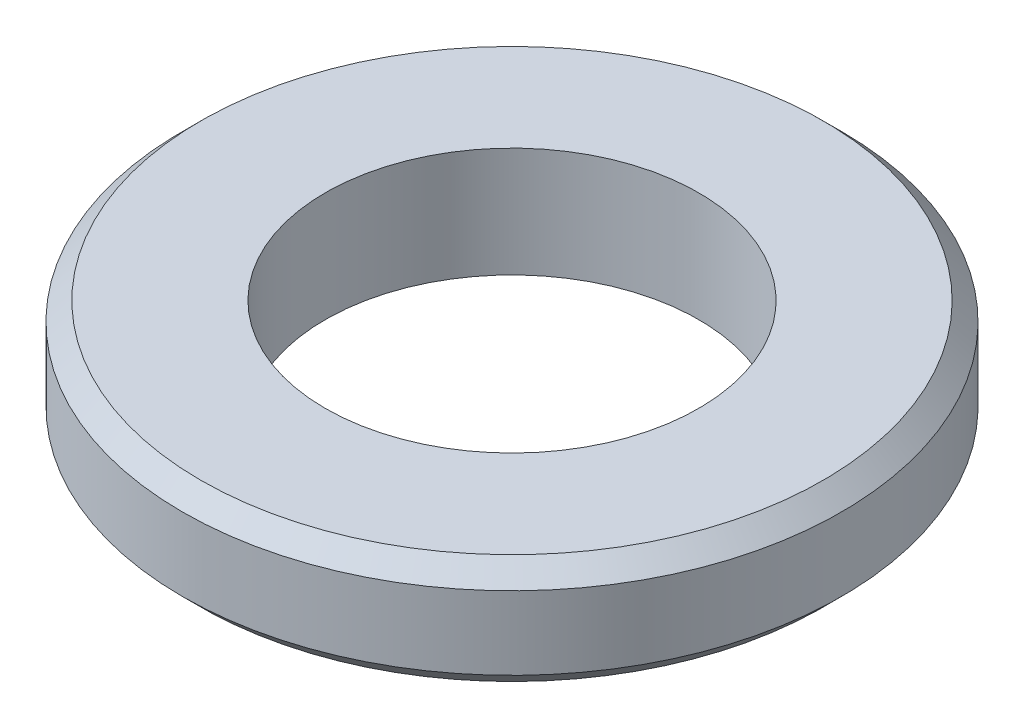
ISO-10303-21;
HEADER;
FILE_DESCRIPTION(('STEP AP214'),'2;1');
FILE_NAME('part.step','',(''),(''),'','','');
FILE_SCHEMA(('AUTOMOTIVE_DESIGN { 1 0 10303 214 1 1 1 1 }'));
ENDSEC;
DATA;
#1=APPLICATION_CONTEXT('core data for automotive mechanical design processes');
#2=APPLICATION_PROTOCOL_DEFINITION('international standard','automotive_design',2000,#1);
#3=PRODUCT_CONTEXT('',#1,'mechanical');
#4=PRODUCT('Part','Part','',(#3));
#5=PRODUCT_RELATED_PRODUCT_CATEGORY('part','',(#4));
#6=PRODUCT_DEFINITION_FORMATION('','',#4);
#7=PRODUCT_DEFINITION_CONTEXT('part definition',#1,'design');
#8=PRODUCT_DEFINITION('design','',#6,#7);
#9=PRODUCT_DEFINITION_SHAPE('','',#8);
#10=(LENGTH_UNIT() NAMED_UNIT(*) SI_UNIT(.MILLI.,.METRE.));
#11=(NAMED_UNIT(*) PLANE_ANGLE_UNIT() SI_UNIT($,.RADIAN.));
#12=(NAMED_UNIT(*) SI_UNIT($,.STERADIAN.) SOLID_ANGLE_UNIT());
#13=UNCERTAINTY_MEASURE_WITH_UNIT(LENGTH_MEASURE(1.E-05),#10,'distance_accuracy_value','');
#14=(GEOMETRIC_REPRESENTATION_CONTEXT(3) GLOBAL_UNCERTAINTY_ASSIGNED_CONTEXT((#13)) GLOBAL_UNIT_ASSIGNED_CONTEXT((#10,
#11,#12)) REPRESENTATION_CONTEXT('',''));
#15=CARTESIAN_POINT('',(0.,0.,0.));
#16=DIRECTION('',(0.,0.,1.));
#17=DIRECTION('',(1.,0.,0.));
#18=AXIS2_PLACEMENT_3D('',#15,#16,#17);
#19=CARTESIAN_POINT('',(0.,6.53689538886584,0.));
#20=DIRECTION('',(0.,1.,0.));
#21=DIRECTION('',(0.,0.,1.));
#22=AXIS2_PLACEMENT_3D('',#19,#20,#21);
#23=CYLINDRICAL_SURFACE('',#22,9.);
#24=CARTESIAN_POINT('',(0.,-2.61128311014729,0.));
#25=DIRECTION('',(0.,-1.,0.));
#26=DIRECTION('',(0.,0.,-1.));
#27=AXIS2_PLACEMENT_3D('',#24,#25,#26);
#28=CIRCLE('',#27,9.);
#29=CARTESIAN_POINT('',(0.,-2.61128311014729,-9.));
#30=VERTEX_POINT('',#29);
#31=EDGE_CURVE('E39',#30,#30,#28,.F.);
#32=ORIENTED_EDGE('',*,*,#31,.T.);
#33=EDGE_LOOP('',(#32));
#34=FACE_BOUND('',#33,.T.);
#35=CARTESIAN_POINT('',(0.,-0.611283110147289,0.));
#36=DIRECTION('',(0.,1.,0.));
#37=DIRECTION('',(0.,0.,1.));
#38=AXIS2_PLACEMENT_3D('',#35,#36,#37);
#39=CIRCLE('',#38,9.);
#40=CARTESIAN_POINT('',(0.,-0.611283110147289,9.));
#41=VERTEX_POINT('',#40);
#42=EDGE_CURVE('E43',#41,#41,#39,.F.);
#43=ORIENTED_EDGE('',*,*,#42,.T.);
#44=EDGE_LOOP('',(#43));
#45=FACE_BOUND('',#44,.T.);
#46=ADVANCED_FACE('F28',(#34,#45),#23,.T.);
#47=CARTESIAN_POINT('',(-9.,-3.11128311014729,0.));
#48=DIRECTION('',(0.,-1.,0.));
#49=DIRECTION('',(0.,0.,-1.));
#50=AXIS2_PLACEMENT_3D('',#47,#48,#49);
#51=PLANE('',#50);
#52=CARTESIAN_POINT('',(0.,-3.11128311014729,0.));
#53=DIRECTION('',(0.,-1.,0.));
#54=DIRECTION('',(0.,0.,-1.));
#55=AXIS2_PLACEMENT_3D('',#52,#53,#54);
#56=CIRCLE('',#55,8.5);
#57=CARTESIAN_POINT('',(0.,-3.11128311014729,-8.5));
#58=VERTEX_POINT('',#57);
#59=EDGE_CURVE('E35',#58,#58,#56,.T.);
#60=ORIENTED_EDGE('',*,*,#59,.T.);
#61=EDGE_LOOP('',(#60));
#62=FACE_BOUND('',#61,.T.);
#63=CARTESIAN_POINT('',(0.,-3.11128311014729,0.));
#64=DIRECTION('',(0.,1.,0.));
#65=DIRECTION('',(0.,0.,1.));
#66=AXIS2_PLACEMENT_3D('',#63,#64,#65);
#67=CIRCLE('',#66,5.1);
#68=CARTESIAN_POINT('',(0.,-3.11128311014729,5.1));
#69=VERTEX_POINT('',#68);
#70=EDGE_CURVE('E48',#69,#69,#67,.T.);
#71=ORIENTED_EDGE('',*,*,#70,.T.);
#72=EDGE_LOOP('',(#71));
#73=FACE_BOUND('',#72,.T.);
#74=ADVANCED_FACE('F59',(#62,#73),#51,.T.);
#75=CARTESIAN_POINT('',(-9.,-0.111283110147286,0.));
#76=DIRECTION('',(0.,1.,0.));
#77=DIRECTION('',(0.,0.,1.));
#78=AXIS2_PLACEMENT_3D('',#75,#76,#77);
#79=PLANE('',#78);
#80=CARTESIAN_POINT('',(0.,-0.111283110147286,0.));
#81=DIRECTION('',(0.,1.,0.));
#82=DIRECTION('',(0.,0.,1.));
#83=AXIS2_PLACEMENT_3D('',#80,#81,#82);
#84=CIRCLE('',#83,8.5);
#85=CARTESIAN_POINT('',(0.,-0.111283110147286,8.5));
#86=VERTEX_POINT('',#85);
#87=EDGE_CURVE('E10',#86,#86,#84,.T.);
#88=ORIENTED_EDGE('',*,*,#87,.T.);
#89=EDGE_LOOP('',(#88));
#90=FACE_BOUND('',#89,.T.);
#91=CARTESIAN_POINT('',(0.,-0.111283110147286,0.));
#92=DIRECTION('',(0.,1.,0.));
#93=DIRECTION('',(0.,0.,1.));
#94=AXIS2_PLACEMENT_3D('',#91,#92,#93);
#95=CIRCLE('',#94,5.09999999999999);
#96=CARTESIAN_POINT('',(0.,-0.111283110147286,5.09999999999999));
#97=VERTEX_POINT('',#96);
#98=EDGE_CURVE('E51',#97,#97,#95,.T.);
#99=ORIENTED_EDGE('',*,*,#98,.F.);
#100=EDGE_LOOP('',(#99));
#101=FACE_BOUND('',#100,.T.);
#102=ADVANCED_FACE('F57',(#90,#101),#79,.T.);
#103=CARTESIAN_POINT('',(0.,-0.111283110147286,0.));
#104=DIRECTION('',(0.,1.,0.));
#105=DIRECTION('',(0.,0.,1.));
#106=AXIS2_PLACEMENT_3D('',#103,#104,#105);
#107=CYLINDRICAL_SURFACE('',#106,5.09999999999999);
#108=ORIENTED_EDGE('',*,*,#70,.F.);
#109=EDGE_LOOP('',(#108));
#110=FACE_BOUND('',#109,.T.);
#111=ORIENTED_EDGE('',*,*,#98,.T.);
#112=EDGE_LOOP('',(#111));
#113=FACE_BOUND('',#112,.T.);
#114=ADVANCED_FACE('F55',(#110,#113),#107,.F.);
#115=CARTESIAN_POINT('',(0.,-2.61128311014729,0.));
#116=DIRECTION('',(0.,1.,0.));
#117=DIRECTION('',(0.,0.,1.));
#118=AXIS2_PLACEMENT_3D('',#115,#116,#117);
#119=CONICAL_SURFACE('',#118,9.,0.785398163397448);
#120=ORIENTED_EDGE('',*,*,#59,.F.);
#121=EDGE_LOOP('',(#120));
#122=FACE_BOUND('',#121,.T.);
#123=ORIENTED_EDGE('',*,*,#31,.F.);
#124=EDGE_LOOP('',(#123));
#125=FACE_BOUND('',#124,.T.);
#126=ADVANCED_FACE('F65',(#122,#125),#119,.T.);
#127=CARTESIAN_POINT('',(0.,-0.111283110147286,0.));
#128=DIRECTION('',(0.,-1.,0.));
#129=DIRECTION('',(0.,0.,-1.));
#130=AXIS2_PLACEMENT_3D('',#127,#128,#129);
#131=CONICAL_SURFACE('',#130,8.5,0.785398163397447);
#132=ORIENTED_EDGE('',*,*,#42,.F.);
#133=EDGE_LOOP('',(#132));
#134=FACE_BOUND('',#133,.T.);
#135=ORIENTED_EDGE('',*,*,#87,.F.);
#136=EDGE_LOOP('',(#135));
#137=FACE_BOUND('',#136,.T.);
#138=ADVANCED_FACE('F30',(#134,#137),#131,.T.);
#139=CLOSED_SHELL('',(#46,#74,#102,#114,#126,#138));
#140=MANIFOLD_SOLID_BREP('B2',#139);
#141=ADVANCED_BREP_SHAPE_REPRESENTATION('',(#18,#140),#14);
#142=SHAPE_DEFINITION_REPRESENTATION(#9,#141);
ENDSEC;
END-ISO-10303-21;
